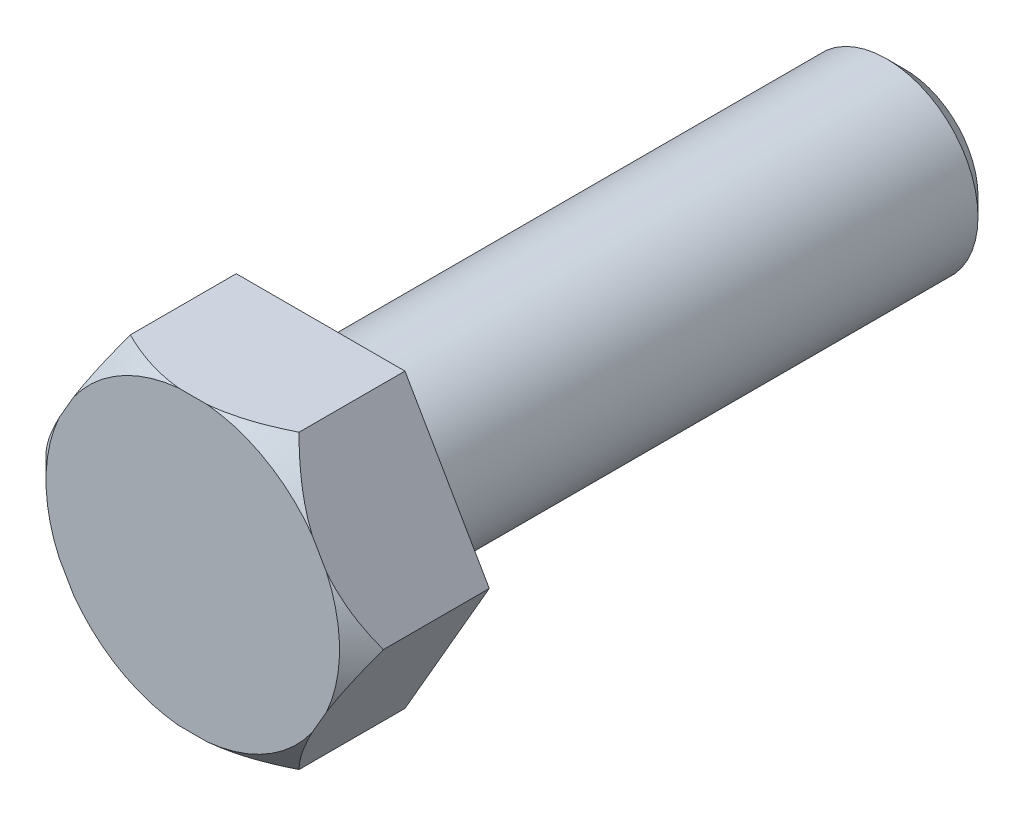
from build123d import *

# Parameters (mm, degrees)
BOSS_EXTRU_1_DEPTH = 3.5


with BuildPart() as part:
    # Esquisse1 → Boss.-Extru.1 (new body)
    with BuildSketch(Plane.XY):
        Polygon((4.618802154, 0), (2.309401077, 4), (-2.309401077, 4), (-4.618802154, 0), (-2.309401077, -4), (2.309401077, -4), align=None)
    extrude(amount=BOSS_EXTRU_1_DEPTH)

    # Esquisse3 → Enl_vement de mati_re-R_volution2 (revolve, cut)
    with BuildSketch(Plane(origin=(0, 0, 0), x_dir=(1, 0, 0), z_dir=(0, 1, 0))):
        Polygon((-4.618802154, -2.9), (-4.018802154, -3.5), (-4.018802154, -6.542860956), (-9.024896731, -6.542860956), (-9.024896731, -2.9), align=None)
    revolve(axis=Axis((0, 0, -2.903094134), (0, 0, 1)), mode=Mode.SUBTRACT)


with BuildPart() as body_2:
    # Esquisse4 → R_volution2 (revolve)
    with BuildSketch(Plane(origin=(0, 0, 0), x_dir=(0, 0, -1), z_dir=(1, 0, 0)), mode=Mode.PRIVATE) as r_volution2_sk:
        Polygon((0, -2.5), (15.5, -2.5), (16, -2), (16, 0), (0, 0), align=None)
    revolve(r_volution2_sk.sketch.rotate(Axis((0, 0, 0), (0, 0, -1)), 270), axis=Axis((0, 0, 0), (0, 0, -1)))


solid = Compound([part.part, body_2.part])
